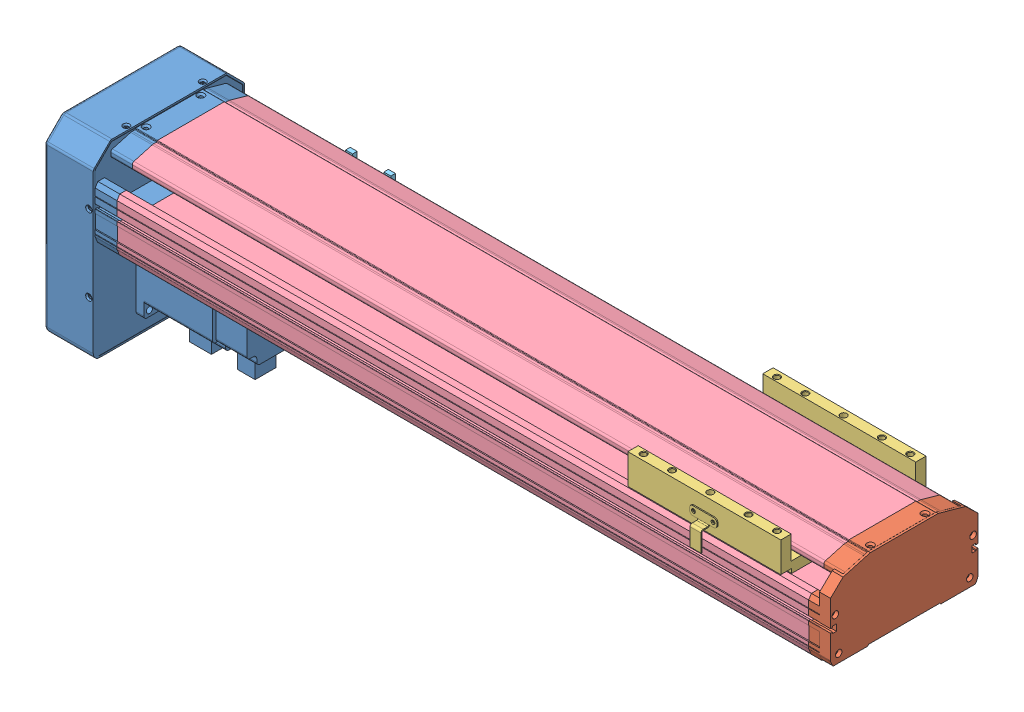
SolidWorks assembly TCD135-P-J2BL-0.SLDASM, configuration 450 (file format 9000). Lengths in mm.
Overall size (718.02 170.5 155.4).
7 component instances, 5 part files, 19 mates.
Components (placement in the parent):
- TCD135-P-J2BL-4-1: TCD135-P-J2BL-4.SLDPRT [默认] at (45 0 0)
- TCD135-P-J2BL-2-1: TCD135-P-J2BL-2.sldprt [默认] at (308 0 0)
- TCD135-P-J2BL-1-1: TCD135-P-J2BL-1.sldprt [默认] at (395 35.5 0) x (0 0 -1) z (1 0 0)
- TCD135-P-J2BL-3-1: TCD135-P-J2BL-3.SLDPRT [450] at (491.5 1.6 0) x (0 0 1) z (-1 0 0) size (135 73.5 633)
- TCD135-P-J2BL-5-1: TCD135-P-J2BL-5.sldprt [默认] at (-216.7996 -3.6004 -11) x (0 0 -1) z (1 0 0)
- TCD135-P-J2BL-5-2: TCD135-P-J2BL-5.sldprt [默认] at (251.8004 -3.6004 -11) x (0 0 -1) z (1 0 0)
- TCD135-P-J2BL-5-3: TCD135-P-J2BL-5.sldprt [默认] at (-181.7996 -3.6004 -11) x (0 0 -1) z (1 0 0)
Mates (geometry in assembly coordinates):
- 距离1: distance = 0.5 mm aligned: plane of TCD135-P-J2BL-1-1 through (395 64.25 66.5) normal (0 0 1); plane of TCD135-P-J2BL-3-1 through (-141.5 11.6 67) normal (0 0 1)
- 距离2: distance = 78 mm anti-aligned: plane of TCD135-P-J2BL-1-1 through (395 78 61.75) normal (0 1 0); plane of TCD135-P-J2BL-3-1 through (-141.5 0 34.1) normal (0 -1 0)
- 重合13: coincident anti-aligned: plane of TCD135-P-J2BL-2-1 through (491.5 24.1 0) normal (-1 0 0); plane of TCD135-P-J2BL-3-1 through (491.5 26.3 57) normal (1 0 0)
- 重合14: coincident aligned: plane of TCD135-P-J2BL-2-1 through (496.5 17.6 67) normal (0 0 1); plane of TCD135-P-J2BL-3-1 through (-141.5 11.6 67) normal (0 0 1)
- 重合15: coincident aligned: plane of TCD135-P-J2BL-2-1 through (496.5 0 49.63) normal (0 -1 0); plane of TCD135-P-J2BL-3-1 through (-141.5 0 34.1) normal (0 -1 0)
- LimitDistance1: limit distance = 531.5 mm aligned: plane of TCD135-P-J2BL-1-1 through (325 62.25 0) normal (-1 0 0); plane of TCD135-P-J2BL-4-1 through (-206.5 -8.5 0) normal (-1 0 0)
- LimitDistance2: limit distance = 46.5 mm aligned: plane of TCD135-P-J2BL-1-1 through (465 62.25 0) normal (1 0 0); plane of TCD135-P-J2BL-2-1 through (511.5 37 0) normal (1 0 0)
- 重合20: coincident aligned: plane of TCD135-P-J2BL-3-1 through (-141.5 73.5 30.5) normal (0 1 0); plane of TCD135-P-J2BL-4-1 through (49.1 73.5 0) normal (0 1 0)
- 重合21: coincident aligned: plane of TCD135-P-J2BL-3-1 through (-141.5 11.6 67) normal (0 0 1); plane of TCD135-P-J2BL-4-1 through (45 17.6 67) normal (0 0 1)
- 重合22: coincident anti-aligned: plane of TCD135-P-J2BL-3-1 through (-141.5 26.3 57) normal (-1 0 0); plane of TCD135-P-J2BL-4-1 through (-141.5 623.0854 125.2888) normal (1 0 0)
- 重合23: coincident anti-aligned: plane of TCD135-P-J2BL-3-1 through (-141.5 27.5 -67.5) normal (0 0 -1); plane of TCD135-P-J2BL-5-1 through (-60.3 18.6 -67.5) normal (0 0 1)
- 重合24: coincident aligned: plane of TCD135-P-J2BL-3-1 through (-141.5 27.8 -65.8) normal (0 1 0); plane of TCD135-P-J2BL-5-1 through (-83.9 27.8 -67.5) normal (0 1 0)
- 重合25: coincident anti-aligned: plane of TCD135-P-J2BL-3-1 through (-141.5 27.5 -67.5) normal (0 0 -1); plane of TCD135-P-J2BL-5-2 through (408.3 18.6 -67.5) normal (0 0 1)
- 重合26: coincident aligned: plane of TCD135-P-J2BL-3-1 through (-141.5 27.8 -65.8) normal (0 1 0); plane of TCD135-P-J2BL-5-2 through (384.7 27.8 -67.5) normal (0 1 0)
- 重合27: coincident anti-aligned: plane of TCD135-P-J2BL-3-1 through (-141.5 27.5 -67.5) normal (0 0 -1); plane of TCD135-P-J2BL-5-3 through (-25.3 18.6 -67.5) normal (0 0 1)
- 重合28: coincident aligned: plane of TCD135-P-J2BL-3-1 through (-141.5 27.8 -65.8) normal (0 1 0); plane of TCD135-P-J2BL-5-3 through (-48.9 27.8 -67.5) normal (0 1 0)
- 距离3: distance = 35 mm aligned: plane of TCD135-P-J2BL-5-3 through (-41.5 18.6 -67.5) normal (-1 0 0); plane of TCD135-P-J2BL-5-1 through (-76.5 18.6 -67.5) normal (-1 0 0)
- 距离4: distance = 130 mm aligned: plane of TCD135-P-J2BL-5-1 through (-76.5 18.6 -67.5) normal (-1 0 0); plane of TCD135-P-J2BL-4-1 through (-206.5 -8.5 0) normal (-1 0 0)
- 距离5: distance = 113 mm aligned: plane of TCD135-P-J2BL-5-2 through (398.5 18.6 -67.5) normal (1 0 0); plane of TCD135-P-J2BL-2-1 through (511.5 37 0) normal (1 0 0)
